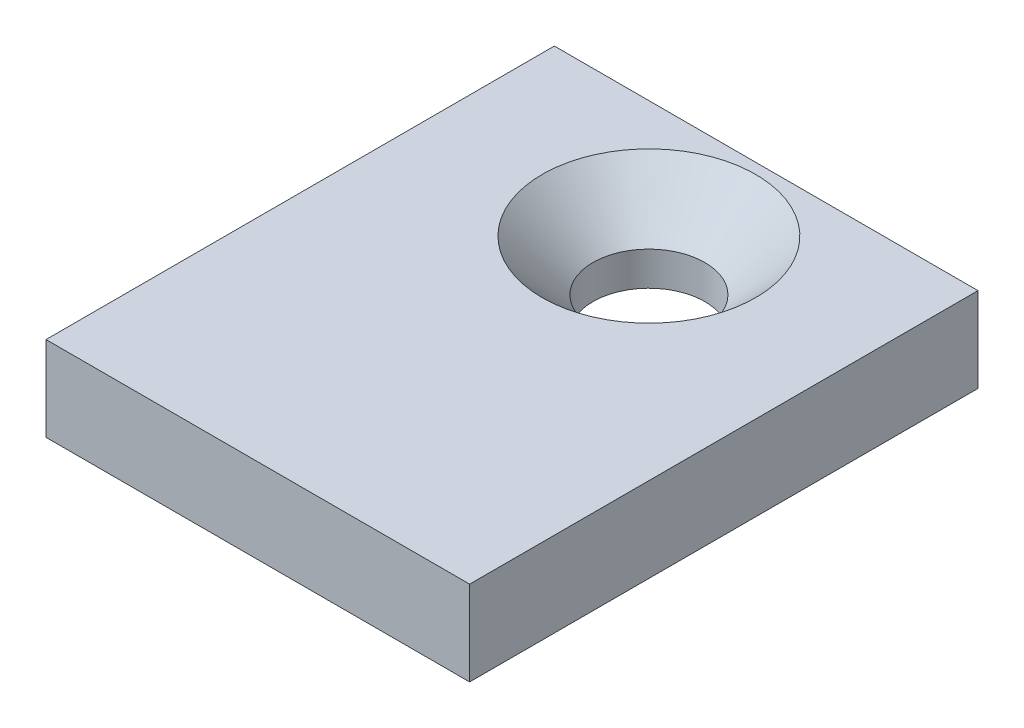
from build123d import *

# Parameters (mm, degrees)
ESQUISSE1_W        = 25
ESQUISSE1_H        = 5
BOSS_EXTRU_1_DEPTH = 30


with BuildPart() as part:
    # Esquisse1 → Boss.-Extru.1 (new body)
    with BuildSketch(Plane.XY):
        with Locations((17.708063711, 2.307137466)):
            Rectangle(ESQUISSE1_W, ESQUISSE1_H)
    extrude(amount=BOSS_EXTRU_1_DEPTH)

    # Esquisse5 → Fraisage pour vis _ t_te frais_e M61 (revolve, cut)
    with BuildSketch(Plane(origin=(17.708063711, 4.807137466, 6.920269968), x_dir=(0, 0, 1), z_dir=(1, 0, 0))):
        Polygon((0, 0), (0, 5), (3.3, 5), (3.3, 3), (6.3, 0), align=None)
    revolve(axis=Axis((17.708063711, 11.157137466, 6.920269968), (0, -1, 0)), mode=Mode.SUBTRACT)


solid = part.part
